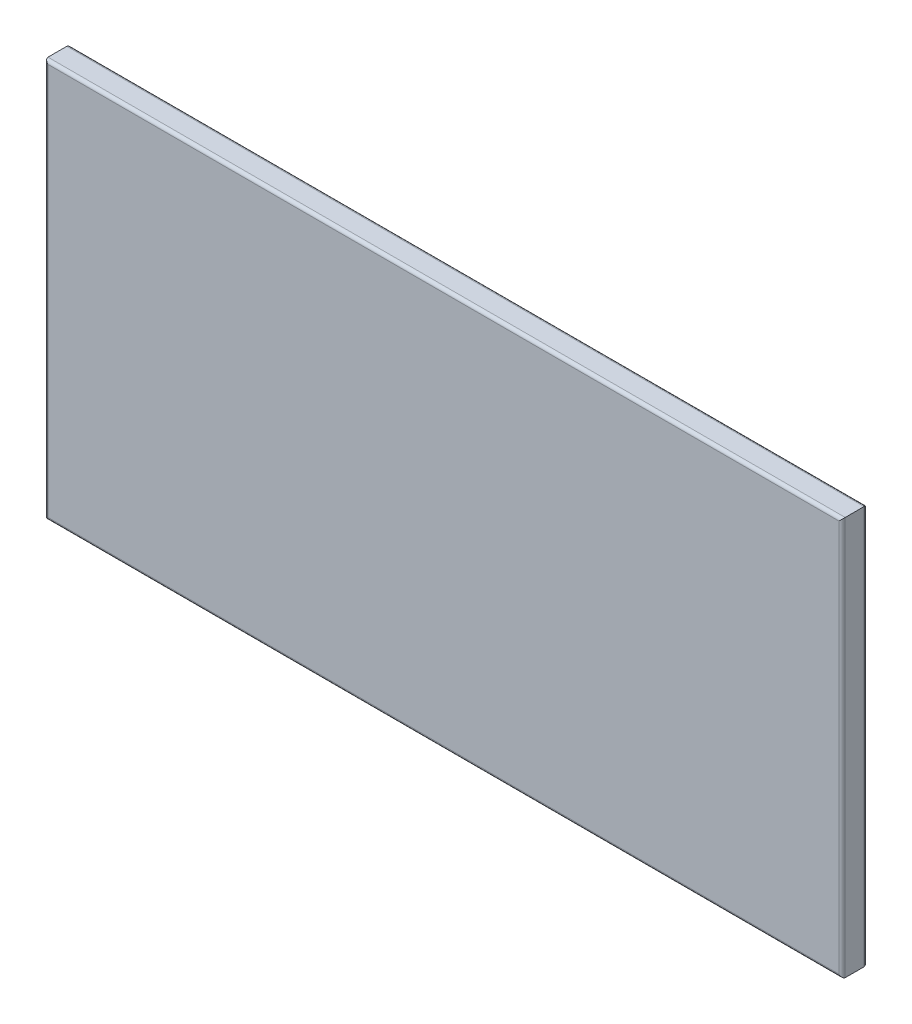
from build123d import *

# Parameters (mm, degrees)
SKIZZE1_W                       = 63.6
SKIZZE1_H                       = 31.8
AUFSATZ_LINEAR_AUSTRAGEN1_DEPTH = 2
VERRUNDUNG1_R                   = 0.25


with BuildPart() as part:
    # Skizze1 → Aufsatz-Linear austragen1 (new body)
    with BuildSketch(Plane.XY):
        Rectangle(SKIZZE1_W, SKIZZE1_H)
    extrude(amount=AUFSATZ_LINEAR_AUSTRAGEN1_DEPTH)

    # Verrundung1
    verrundung1_edges = [part.edges().sort_by_distance(p)[0] for p in [
        (-31.8, 0, 2),
        (0, -15.9, 2),
        (31.8, 0, 2),
        (0, -15.9, 0),
        (-31.8, 0, 0),
        (0, 15.9, 0),
        (31.8, 0, 0),
        (0, 15.9, 2),
    ]]
    fillet(verrundung1_edges, radius=VERRUNDUNG1_R)


solid = part.part
